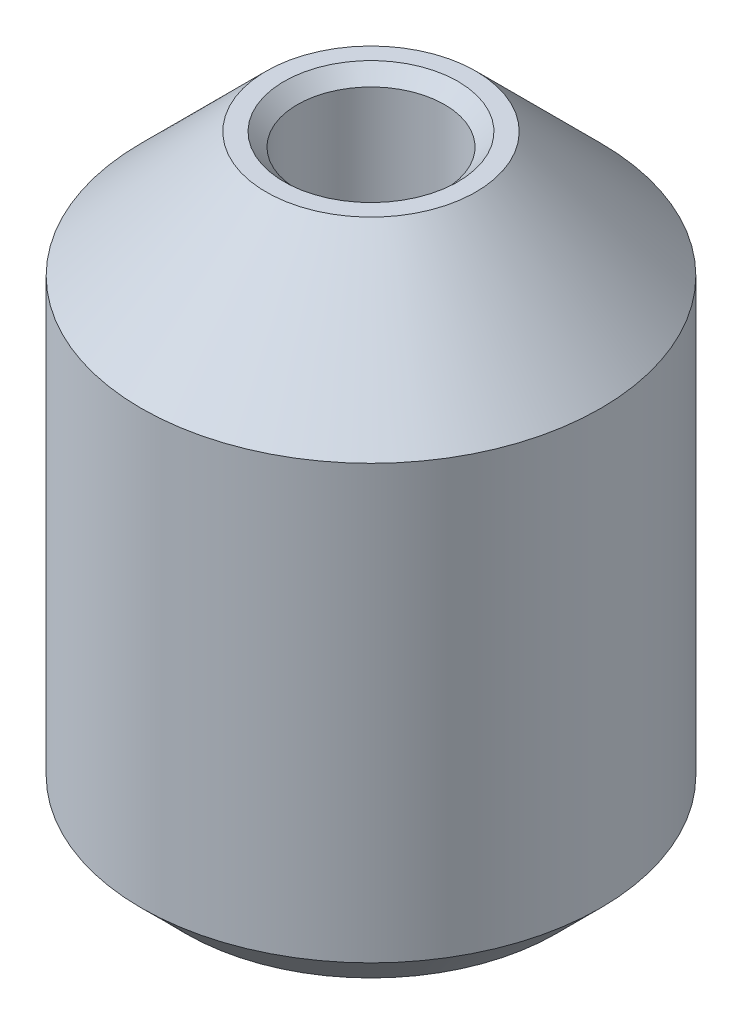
from build123d import *

# Parameters (mm, degrees)
ENL_V_MAT_EXTRU_1_DEPTH = 9
CHANFREIN1_SIZE         = 0.6
CHANFREIN2_SIZE         = 0.75


with BuildPart() as part:
    # Esquisse2 → R_volution1 (revolve)
    with BuildSketch(Plane.XY, mode=Mode.PRIVATE) as r_volution1_sk:
        with BuildLine():
            Line((-4.7, 27), (-3.3, 27))
            Line((-3.3, 27), (-3.3, 13.5))
            ThreePointArc((-3.3, 13.5), (-2.860660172, 12.439339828), (-1.8, 12))
            Line((-1.8, 12), (0, 12))
            Line((0, 12), (0, 0))
            Line((0, 0), (-8.3, 0))
            Line((-8.3, 0), (-10.3, 2))
            Line((-10.3, 2), (-10.3, 21.4))
            Line((-10.3, 21.4), (-4.7, 27))
        make_face()
    revolve(r_volution1_sk.sketch.rotate(Axis((0, 0, 0), (0, 1, 0)), 270), axis=Axis((0, 0, 0), (0, 1, 0)))

    # Esquisse3 → Enl_v. mat.-Extru.1 (cut)
    with BuildSketch(Plane.XZ):
        with BuildLine():
            Line((-1.875, -2.341874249), (-1.875, 2.341874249))
            ThreePointArc((-1.875, 2.341874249), (0, 3), (1.875, 2.341874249))
            Line((1.875, 2.341874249), (1.875, -2.341874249))
            ThreePointArc((1.875, -2.341874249), (0, -3), (-1.875, -2.341874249))
        make_face()
    extrude(amount=-ENL_V_MAT_EXTRU_1_DEPTH, mode=Mode.SUBTRACT)

    # Chanfrein1
    chanfrein1_edges = [part.edges().sort_by_distance(p)[0] for p in [
        (0, 27, 3.3),
    ]]
    chamfer(chanfrein1_edges, length=CHANFREIN1_SIZE)

    # Chanfrein2
    chanfrein2_edges = [part.edges().sort_by_distance(p)[0] for p in [
        (0, 0, -3),
        (1.875, 0, 0),
        (0, 0, 3),
        (-1.875, 0, 0),
    ]]
    chamfer(chanfrein2_edges, length=CHANFREIN2_SIZE)


solid = part.part
